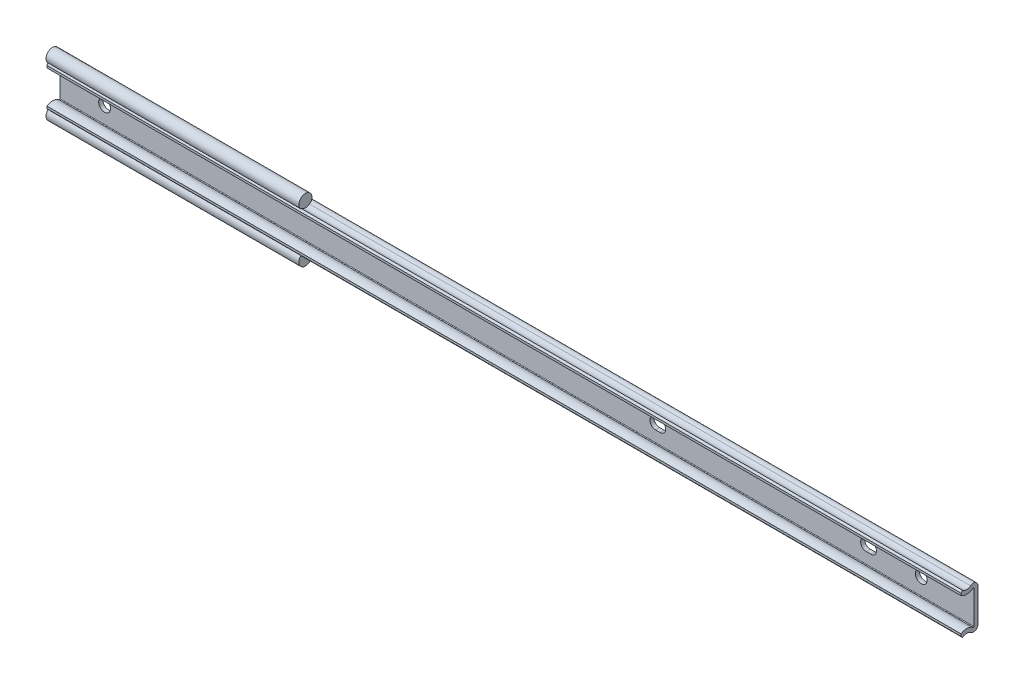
ISO-10303-21;
HEADER;
FILE_DESCRIPTION(('STEP AP214'),'2;1');
FILE_NAME('part.step','',(''),(''),'','','');
FILE_SCHEMA(('AUTOMOTIVE_DESIGN { 1 0 10303 214 1 1 1 1 }'));
ENDSEC;
DATA;
#1=APPLICATION_CONTEXT('core data for automotive mechanical design processes');
#2=APPLICATION_PROTOCOL_DEFINITION('international standard','automotive_design',2000,#1);
#3=PRODUCT_CONTEXT('',#1,'mechanical');
#4=PRODUCT('Part','Part','',(#3));
#5=PRODUCT_RELATED_PRODUCT_CATEGORY('part','',(#4));
#6=PRODUCT_DEFINITION_FORMATION('','',#4);
#7=PRODUCT_DEFINITION_CONTEXT('part definition',#1,'design');
#8=PRODUCT_DEFINITION('design','',#6,#7);
#9=PRODUCT_DEFINITION_SHAPE('','',#8);
#10=(LENGTH_UNIT() NAMED_UNIT(*) SI_UNIT(.MILLI.,.METRE.));
#11=(NAMED_UNIT(*) PLANE_ANGLE_UNIT() SI_UNIT($,.RADIAN.));
#12=(NAMED_UNIT(*) SI_UNIT($,.STERADIAN.) SOLID_ANGLE_UNIT());
#13=UNCERTAINTY_MEASURE_WITH_UNIT(LENGTH_MEASURE(1.E-05),#10,'distance_accuracy_value','');
#14=(GEOMETRIC_REPRESENTATION_CONTEXT(3) GLOBAL_UNCERTAINTY_ASSIGNED_CONTEXT((#13)) GLOBAL_UNIT_ASSIGNED_CONTEXT((#10,
#11,#12)) REPRESENTATION_CONTEXT('',''));
#15=CARTESIAN_POINT('',(0.,0.,0.));
#16=DIRECTION('',(0.,0.,1.));
#17=DIRECTION('',(1.,0.,0.));
#18=AXIS2_PLACEMENT_3D('',#15,#16,#17);
#19=CARTESIAN_POINT('',(330.,9.66999972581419,4.30999993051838));
#20=DIRECTION('',(-1.,0.,0.));
#21=DIRECTION('',(0.,0.,1.));
#22=AXIS2_PLACEMENT_3D('',#19,#20,#21);
#23=CYLINDRICAL_SURFACE('',#22,2.48000011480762);
#24=CARTESIAN_POINT('',(79.,9.66999972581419,4.3099999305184));
#25=DIRECTION('',(-1.,0.,0.));
#26=DIRECTION('',(0.,0.,1.));
#27=AXIS2_PLACEMENT_3D('',#24,#25,#26);
#28=CIRCLE('',#27,2.48000011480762);
#29=CARTESIAN_POINT('',(79.,7.77020940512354,5.90411325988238));
#30=VERTEX_POINT('',#29);
#31=CARTESIAN_POINT('',(79.,7.69573912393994,2.80910165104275));
#32=VERTEX_POINT('',#31);
#33=EDGE_CURVE('E228',#30,#32,#28,.F.);
#34=ORIENTED_EDGE('',*,*,#33,.F.);
#35=DIRECTION('',(-1.,0.,0.));
#36=VECTOR('',#35,1.);
#37=CARTESIAN_POINT('',(330.,7.77020940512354,5.90411325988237));
#38=LINE('',#37,#36);
#39=CARTESIAN_POINT('',(330.,7.77020940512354,5.90411325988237));
#40=VERTEX_POINT('',#39);
#41=EDGE_CURVE('E350',#40,#30,#38,.T.);
#42=ORIENTED_EDGE('',*,*,#41,.F.);
#43=CARTESIAN_POINT('',(330.,9.66999972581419,4.30999993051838));
#44=DIRECTION('',(-1.,0.,0.));
#45=DIRECTION('',(0.,0.,-1.));
#46=AXIS2_PLACEMENT_3D('',#43,#44,#45);
#47=CIRCLE('',#46,2.48000011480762);
#48=CARTESIAN_POINT('',(330.,7.69573912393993,2.80910165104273));
#49=VERTEX_POINT('',#48);
#50=EDGE_CURVE('E324',#49,#40,#47,.T.);
#51=ORIENTED_EDGE('',*,*,#50,.F.);
#52=DIRECTION('',(-1.,0.,0.));
#53=VECTOR('',#52,1.);
#54=CARTESIAN_POINT('',(330.,7.69573912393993,2.80910165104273));
#55=LINE('',#54,#53);
#56=EDGE_CURVE('E353',#49,#32,#55,.T.);
#57=ORIENTED_EDGE('',*,*,#56,.T.);
#58=EDGE_LOOP('',(#34,#42,#51,#57));
#59=FACE_BOUND('',#58,.T.);
#60=ADVANCED_FACE('F14',(#59),#23,.F.);
#61=CARTESIAN_POINT('',(330.,-9.66999990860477,4.30999993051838));
#62=DIRECTION('',(-1.,0.,0.));
#63=DIRECTION('',(0.,0.,1.));
#64=AXIS2_PLACEMENT_3D('',#61,#62,#63);
#65=CYLINDRICAL_SURFACE('',#64,4.03000011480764);
#66=DIRECTION('',(-1.,0.,0.));
#67=VECTOR('',#66,1.);
#68=CARTESIAN_POINT('',(330.,-6.46182654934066,1.87104018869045));
#69=LINE('',#68,#67);
#70=CARTESIAN_POINT('',(330.,-6.46182654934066,1.87104018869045));
#71=VERTEX_POINT('',#70);
#72=CARTESIAN_POINT('',(-17.,-6.46182654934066,1.87104018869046));
#73=VERTEX_POINT('',#72);
#74=EDGE_CURVE('E338',#71,#73,#69,.T.);
#75=ORIENTED_EDGE('',*,*,#74,.T.);
#76=CARTESIAN_POINT('',(-17.,-9.66999990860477,4.3099999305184));
#77=DIRECTION('',(-1.,0.,0.));
#78=DIRECTION('',(0.,0.,1.));
#79=AXIS2_PLACEMENT_3D('',#76,#77,#78);
#80=CIRCLE('',#79,4.03000011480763);
#81=CARTESIAN_POINT('',(-17.,-6.26775055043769,6.4699999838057));
#82=VERTEX_POINT('',#81);
#83=EDGE_CURVE('E232',#82,#73,#80,.T.);
#84=ORIENTED_EDGE('',*,*,#83,.F.);
#85=DIRECTION('',(-1.,0.,0.));
#86=VECTOR('',#85,1.);
#87=CARTESIAN_POINT('',(330.,-6.26775055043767,6.4699999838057));
#88=LINE('',#87,#86);
#89=CARTESIAN_POINT('',(330.,-6.26775055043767,6.4699999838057));
#90=VERTEX_POINT('',#89);
#91=EDGE_CURVE('E368',#90,#82,#88,.T.);
#92=ORIENTED_EDGE('',*,*,#91,.F.);
#93=CARTESIAN_POINT('',(330.,-9.66999990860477,4.30999993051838));
#94=DIRECTION('',(1.,0.,0.));
#95=DIRECTION('',(0.,0.,1.));
#96=AXIS2_PLACEMENT_3D('',#93,#94,#95);
#97=CIRCLE('',#96,4.03000011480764);
#98=EDGE_CURVE('E309',#71,#90,#97,.T.);
#99=ORIENTED_EDGE('',*,*,#98,.F.);
#100=EDGE_LOOP('',(#75,#84,#92,#99));
#101=FACE_BOUND('',#100,.T.);
#102=ADVANCED_FACE('F16',(#101),#65,.T.);
#103=CARTESIAN_POINT('',(330.,-6.26775055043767,6.4699999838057));
#104=DIRECTION('',(0.,0.,-1.));
#105=DIRECTION('',(-1.,0.,0.));
#106=AXIS2_PLACEMENT_3D('',#103,#104,#105);
#107=PLANE('',#106);
#108=ORIENTED_EDGE('',*,*,#91,.T.);
#109=DIRECTION('',(0.,1.,0.));
#110=VECTOR('',#109,1.);
#111=CARTESIAN_POINT('',(-17.,-7.09581181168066,6.46999998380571));
#112=LINE('',#111,#110);
#113=CARTESIAN_POINT('',(-17.,-7.09581181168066,6.46999998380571));
#114=VERTEX_POINT('',#113);
#115=EDGE_CURVE('E262',#114,#82,#112,.T.);
#116=ORIENTED_EDGE('',*,*,#115,.F.);
#117=DIRECTION('',(-1.,0.,0.));
#118=VECTOR('',#117,1.);
#119=CARTESIAN_POINT('',(330.,-7.09581181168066,6.4699999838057));
#120=LINE('',#119,#118);
#121=CARTESIAN_POINT('',(330.,-7.09581181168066,6.4699999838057));
#122=VERTEX_POINT('',#121);
#123=EDGE_CURVE('E366',#122,#114,#120,.T.);
#124=ORIENTED_EDGE('',*,*,#123,.F.);
#125=DIRECTION('',(0.,-1.,0.));
#126=VECTOR('',#125,1.);
#127=CARTESIAN_POINT('',(330.,-6.26775055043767,6.4699999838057));
#128=LINE('',#127,#126);
#129=EDGE_CURVE('E312',#90,#122,#128,.T.);
#130=ORIENTED_EDGE('',*,*,#129,.F.);
#131=EDGE_LOOP('',(#108,#116,#124,#130));
#132=FACE_BOUND('',#131,.T.);
#133=ADVANCED_FACE('F456',(#132),#107,.F.);
#134=CARTESIAN_POINT('',(330.,-7.77020958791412,5.90411325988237));
#135=DIRECTION('',(0.,0.642787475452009,-0.766044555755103));
#136=DIRECTION('',(0.,0.766044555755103,0.642787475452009));
#137=AXIS2_PLACEMENT_3D('',#134,#135,#136);
#138=PLANE('',#137);
#139=DIRECTION('',(0.,0.7660445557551,0.642787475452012));
#140=VECTOR('',#139,1.);
#141=CARTESIAN_POINT('',(-17.,-7.77020958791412,5.90411325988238));
#142=LINE('',#141,#140);
#143=CARTESIAN_POINT('',(-17.,-7.65539913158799,6.00045063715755));
#144=VERTEX_POINT('',#143);
#145=EDGE_CURVE('E211',#144,#114,#142,.T.);
#146=ORIENTED_EDGE('',*,*,#145,.F.);
#147=DIRECTION('',(-1.,0.,0.));
#148=VECTOR('',#147,1.);
#149=CARTESIAN_POINT('',(79.,-7.65539913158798,6.00045063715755));
#150=LINE('',#149,#148);
#151=CARTESIAN_POINT('',(79.,-7.65539913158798,6.00045063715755));
#152=VERTEX_POINT('',#151);
#153=EDGE_CURVE('E202',#144,#152,#150,.F.);
#154=ORIENTED_EDGE('',*,*,#153,.T.);
#155=DIRECTION('',(0.,-0.766044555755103,-0.642787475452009));
#156=VECTOR('',#155,1.);
#157=CARTESIAN_POINT('',(79.,-7.77020958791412,5.90411325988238));
#158=LINE('',#157,#156);
#159=CARTESIAN_POINT('',(79.,-7.77020958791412,5.90411325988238));
#160=VERTEX_POINT('',#159);
#161=EDGE_CURVE('E188',#152,#160,#158,.T.);
#162=ORIENTED_EDGE('',*,*,#161,.T.);
#163=DIRECTION('',(-1.,0.,0.));
#164=VECTOR('',#163,1.);
#165=CARTESIAN_POINT('',(330.,-7.77020958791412,5.90411325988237));
#166=LINE('',#165,#164);
#167=CARTESIAN_POINT('',(330.,-7.77020958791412,5.90411325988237));
#168=VERTEX_POINT('',#167);
#169=EDGE_CURVE('E364',#168,#160,#166,.T.);
#170=ORIENTED_EDGE('',*,*,#169,.F.);
#171=DIRECTION('',(0.,-0.766044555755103,-0.642787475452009));
#172=VECTOR('',#171,1.);
#173=CARTESIAN_POINT('',(330.,-7.77020958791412,5.90411325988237));
#174=LINE('',#173,#172);
#175=EDGE_CURVE('E314',#122,#168,#174,.T.);
#176=ORIENTED_EDGE('',*,*,#175,.F.);
#177=ORIENTED_EDGE('',*,*,#123,.T.);
#178=EDGE_LOOP('',(#146,#154,#162,#170,#176,#177));
#179=FACE_BOUND('',#178,.T.);
#180=ADVANCED_FACE('F209',(#179),#138,.F.);
#181=CARTESIAN_POINT('',(330.,-9.66999990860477,4.30999993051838));
#182=DIRECTION('',(-1.,0.,0.));
#183=DIRECTION('',(0.,0.,1.));
#184=AXIS2_PLACEMENT_3D('',#181,#182,#183);
#185=CYLINDRICAL_SURFACE('',#184,2.48000011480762);
#186=ORIENTED_EDGE('',*,*,#169,.T.);
#187=CARTESIAN_POINT('',(79.,-9.66999990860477,4.3099999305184));
#188=DIRECTION('',(1.,0.,0.));
#189=DIRECTION('',(0.,0.,-1.));
#190=AXIS2_PLACEMENT_3D('',#187,#188,#189);
#191=CIRCLE('',#190,2.48000011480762);
#192=CARTESIAN_POINT('',(79.,-7.69573930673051,2.80910165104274));
#193=VERTEX_POINT('',#192);
#194=EDGE_CURVE('E193',#160,#193,#191,.F.);
#195=ORIENTED_EDGE('',*,*,#194,.T.);
#196=DIRECTION('',(-1.,0.,0.));
#197=VECTOR('',#196,1.);
#198=CARTESIAN_POINT('',(330.,-7.69573930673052,2.80910165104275));
#199=LINE('',#198,#197);
#200=CARTESIAN_POINT('',(330.,-7.69573930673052,2.80910165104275));
#201=VERTEX_POINT('',#200);
#202=EDGE_CURVE('E361',#201,#193,#199,.T.);
#203=ORIENTED_EDGE('',*,*,#202,.F.);
#204=CARTESIAN_POINT('',(330.,-9.66999990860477,4.30999993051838));
#205=DIRECTION('',(-1.,0.,0.));
#206=DIRECTION('',(0.,0.,1.));
#207=AXIS2_PLACEMENT_3D('',#204,#205,#206);
#208=CIRCLE('',#207,2.48000011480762);
#209=EDGE_CURVE('E316',#168,#201,#208,.T.);
#210=ORIENTED_EDGE('',*,*,#209,.F.);
#211=EDGE_LOOP('',(#186,#195,#203,#210));
#212=FACE_BOUND('',#211,.T.);
#213=ADVANCED_FACE('F463',(#212),#185,.F.);
#214=CARTESIAN_POINT('',(330.,-6.302612,1.74999999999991));
#215=DIRECTION('',(-1.,0.,0.));
#216=DIRECTION('',(0.,0.,1.));
#217=AXIS2_PLACEMENT_3D('',#214,#215,#216);
#218=CYLINDRICAL_SURFACE('',#217,1.74999999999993);
#219=CARTESIAN_POINT('',(79.,-6.302612,1.74999999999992));
#220=DIRECTION('',(1.,0.,0.));
#221=DIRECTION('',(0.,0.,-1.));
#222=AXIS2_PLACEMENT_3D('',#219,#220,#221);
#223=CIRCLE('',#222,1.74999999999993);
#224=CARTESIAN_POINT('',(79.,-7.94495173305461,2.3543345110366));
#225=VERTEX_POINT('',#224);
#226=EDGE_CURVE('E9',#193,#225,#223,.T.);
#227=ORIENTED_EDGE('',*,*,#226,.T.);
#228=DIRECTION('',(-1.,0.,0.));
#229=VECTOR('',#228,1.);
#230=CARTESIAN_POINT('',(31.,-7.94495173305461,2.35433451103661));
#231=LINE('',#230,#229);
#232=CARTESIAN_POINT('',(-17.,-7.94495173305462,2.3543345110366));
#233=VERTEX_POINT('',#232);
#234=EDGE_CURVE('E205',#225,#233,#231,.T.);
#235=ORIENTED_EDGE('',*,*,#234,.T.);
#236=CARTESIAN_POINT('',(-17.,-6.302612,1.74999999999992));
#237=DIRECTION('',(-1.,0.,0.));
#238=DIRECTION('',(0.,0.,1.));
#239=AXIS2_PLACEMENT_3D('',#236,#237,#238);
#240=CIRCLE('',#239,1.74999999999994);
#241=CARTESIAN_POINT('',(-17.,-6.302612,0.));
#242=VERTEX_POINT('',#241);
#243=EDGE_CURVE('E258',#242,#233,#240,.T.);
#244=ORIENTED_EDGE('',*,*,#243,.F.);
#245=DIRECTION('',(-1.,0.,0.));
#246=VECTOR('',#245,1.);
#247=CARTESIAN_POINT('',(330.,-6.302612,0.));
#248=LINE('',#247,#246);
#249=CARTESIAN_POINT('',(330.,-6.302612,0.));
#250=VERTEX_POINT('',#249);
#251=EDGE_CURVE('E359',#250,#242,#248,.T.);
#252=ORIENTED_EDGE('',*,*,#251,.F.);
#253=CARTESIAN_POINT('',(330.,-6.302612,1.74999999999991));
#254=DIRECTION('',(1.,0.,0.));
#255=DIRECTION('',(0.,0.,1.));
#256=AXIS2_PLACEMENT_3D('',#253,#254,#255);
#257=CIRCLE('',#256,1.74999999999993);
#258=EDGE_CURVE('E318',#201,#250,#257,.T.);
#259=ORIENTED_EDGE('',*,*,#258,.F.);
#260=ORIENTED_EDGE('',*,*,#202,.T.);
#261=EDGE_LOOP('',(#227,#235,#244,#252,#259,#260));
#262=FACE_BOUND('',#261,.T.);
#263=ADVANCED_FACE('F465',(#262),#218,.T.);
#264=CARTESIAN_POINT('',(330.,-6.302612,0.));
#265=DIRECTION('',(0.,0.,1.));
#266=DIRECTION('',(1.,0.,0.));
#267=AXIS2_PLACEMENT_3D('',#264,#265,#266);
#268=PLANE('',#267);
#269=DIRECTION('',(-1.,0.,0.));
#270=VECTOR('',#269,1.);
#271=CARTESIAN_POINT('',(210.9,-2.1,0.));
#272=LINE('',#271,#270);
#273=CARTESIAN_POINT('',(210.9,-2.1,0.));
#274=VERTEX_POINT('',#273);
#275=CARTESIAN_POINT('',(209.1,-2.1,0.));
#276=VERTEX_POINT('',#275);
#277=EDGE_CURVE('E266',#274,#276,#272,.T.);
#278=ORIENTED_EDGE('',*,*,#277,.F.);
#279=CARTESIAN_POINT('',(210.9,0.,0.));
#280=DIRECTION('',(0.,0.,-1.));
#281=DIRECTION('',(-1.,0.,0.));
#282=AXIS2_PLACEMENT_3D('',#279,#280,#281);
#283=CIRCLE('',#282,2.1);
#284=CARTESIAN_POINT('',(210.9,2.1,0.));
#285=VERTEX_POINT('',#284);
#286=EDGE_CURVE('E29',#285,#274,#283,.T.);
#287=ORIENTED_EDGE('',*,*,#286,.F.);
#288=DIRECTION('',(1.,0.,0.));
#289=VECTOR('',#288,1.);
#290=CARTESIAN_POINT('',(210.9,2.1,0.));
#291=LINE('',#290,#289);
#292=CARTESIAN_POINT('',(209.1,2.1,0.));
#293=VERTEX_POINT('',#292);
#294=EDGE_CURVE('E271',#293,#285,#291,.T.);
#295=ORIENTED_EDGE('',*,*,#294,.F.);
#296=CARTESIAN_POINT('',(209.1,0.,0.));
#297=DIRECTION('',(0.,0.,-1.));
#298=DIRECTION('',(-1.,0.,0.));
#299=AXIS2_PLACEMENT_3D('',#296,#297,#298);
#300=CIRCLE('',#299,2.1);
#301=EDGE_CURVE('E268',#276,#293,#300,.T.);
#302=ORIENTED_EDGE('',*,*,#301,.F.);
#303=EDGE_LOOP('',(#278,#287,#295,#302));
#304=FACE_BOUND('',#303,.T.);
#305=DIRECTION('',(-1.,0.,0.));
#306=VECTOR('',#305,1.);
#307=CARTESIAN_POINT('',(290.9,-2.1,0.));
#308=LINE('',#307,#306);
#309=CARTESIAN_POINT('',(290.9,-2.1,0.));
#310=VERTEX_POINT('',#309);
#311=CARTESIAN_POINT('',(289.1,-2.1,0.));
#312=VERTEX_POINT('',#311);
#313=EDGE_CURVE('E283',#310,#312,#308,.T.);
#314=ORIENTED_EDGE('',*,*,#313,.F.);
#315=CARTESIAN_POINT('',(290.9,0.,0.));
#316=DIRECTION('',(0.,0.,-1.));
#317=DIRECTION('',(-1.,0.,0.));
#318=AXIS2_PLACEMENT_3D('',#315,#316,#317);
#319=CIRCLE('',#318,2.1);
#320=CARTESIAN_POINT('',(290.9,2.1,0.));
#321=VERTEX_POINT('',#320);
#322=EDGE_CURVE('E277',#321,#310,#319,.T.);
#323=ORIENTED_EDGE('',*,*,#322,.F.);
#324=DIRECTION('',(1.,0.,0.));
#325=VECTOR('',#324,1.);
#326=CARTESIAN_POINT('',(290.9,2.1,0.));
#327=LINE('',#326,#325);
#328=CARTESIAN_POINT('',(289.1,2.1,0.));
#329=VERTEX_POINT('',#328);
#330=EDGE_CURVE('E289',#329,#321,#327,.T.);
#331=ORIENTED_EDGE('',*,*,#330,.F.);
#332=CARTESIAN_POINT('',(289.1,0.,0.));
#333=DIRECTION('',(0.,0.,-1.));
#334=DIRECTION('',(-1.,0.,0.));
#335=AXIS2_PLACEMENT_3D('',#332,#333,#334);
#336=CIRCLE('',#335,2.1);
#337=EDGE_CURVE('E286',#312,#329,#336,.T.);
#338=ORIENTED_EDGE('',*,*,#337,.F.);
#339=EDGE_LOOP('',(#314,#323,#331,#338));
#340=FACE_BOUND('',#339,.T.);
#341=CARTESIAN_POINT('',(310.,0.,0.));
#342=DIRECTION('',(0.,0.,-1.));
#343=DIRECTION('',(-1.,0.,0.));
#344=AXIS2_PLACEMENT_3D('',#341,#342,#343);
#345=CIRCLE('',#344,2.24999999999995);
#346=CARTESIAN_POINT('',(307.75,0.,0.));
#347=VERTEX_POINT('',#346);
#348=EDGE_CURVE('E295',#347,#347,#345,.T.);
#349=ORIENTED_EDGE('',*,*,#348,.F.);
#350=EDGE_LOOP('',(#349));
#351=FACE_BOUND('',#350,.T.);
#352=CARTESIAN_POINT('',(0.,0.,0.));
#353=DIRECTION('',(0.,0.,-1.));
#354=DIRECTION('',(-1.,0.,0.));
#355=AXIS2_PLACEMENT_3D('',#352,#353,#354);
#356=CIRCLE('',#355,2.25);
#357=CARTESIAN_POINT('',(-2.25,0.,0.));
#358=VERTEX_POINT('',#357);
#359=EDGE_CURVE('E305',#358,#358,#356,.T.);
#360=ORIENTED_EDGE('',*,*,#359,.F.);
#361=EDGE_LOOP('',(#360));
#362=FACE_BOUND('',#361,.T.);
#363=ORIENTED_EDGE('',*,*,#251,.T.);
#364=DIRECTION('',(0.,-1.,0.));
#365=VECTOR('',#364,1.);
#366=CARTESIAN_POINT('',(-17.,6.30261181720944,0.));
#367=LINE('',#366,#365);
#368=CARTESIAN_POINT('',(-17.,6.30261181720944,0.));
#369=VERTEX_POINT('',#368);
#370=EDGE_CURVE('E255',#369,#242,#367,.T.);
#371=ORIENTED_EDGE('',*,*,#370,.F.);
#372=DIRECTION('',(-1.,0.,0.));
#373=VECTOR('',#372,1.);
#374=CARTESIAN_POINT('',(330.,6.30261181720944,0.));
#375=LINE('',#374,#373);
#376=CARTESIAN_POINT('',(330.,6.30261181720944,0.));
#377=VERTEX_POINT('',#376);
#378=EDGE_CURVE('E356',#377,#369,#375,.T.);
#379=ORIENTED_EDGE('',*,*,#378,.F.);
#380=DIRECTION('',(0.,1.,0.));
#381=VECTOR('',#380,1.);
#382=CARTESIAN_POINT('',(330.,-6.302612,0.));
#383=LINE('',#382,#381);
#384=EDGE_CURVE('E320',#250,#377,#383,.T.);
#385=ORIENTED_EDGE('',*,*,#384,.F.);
#386=EDGE_LOOP('',(#363,#371,#379,#385));
#387=FACE_BOUND('',#386,.T.);
#388=ADVANCED_FACE('F469',(#304,#340,#351,#362,#387),#268,.F.);
#389=CARTESIAN_POINT('',(330.,6.30261181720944,1.74999999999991));
#390=DIRECTION('',(-1.,0.,0.));
#391=DIRECTION('',(0.,0.,1.));
#392=AXIS2_PLACEMENT_3D('',#389,#390,#391);
#393=CYLINDRICAL_SURFACE('',#392,1.74999999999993);
#394=CARTESIAN_POINT('',(-17.,6.30261181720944,1.74999999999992));
#395=DIRECTION('',(-1.,0.,0.));
#396=DIRECTION('',(0.,0.,1.));
#397=AXIS2_PLACEMENT_3D('',#394,#395,#396);
#398=CIRCLE('',#397,1.74999999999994);
#399=CARTESIAN_POINT('',(-17.,7.94495155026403,2.3543345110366));
#400=VERTEX_POINT('',#399);
#401=EDGE_CURVE('E253',#400,#369,#398,.T.);
#402=ORIENTED_EDGE('',*,*,#401,.F.);
#403=DIRECTION('',(-1.,0.,0.));
#404=VECTOR('',#403,1.);
#405=CARTESIAN_POINT('',(31.,7.94495155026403,2.35433451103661));
#406=LINE('',#405,#404);
#407=CARTESIAN_POINT('',(79.,7.94495155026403,2.3543345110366));
#408=VERTEX_POINT('',#407);
#409=EDGE_CURVE('E225',#400,#408,#406,.F.);
#410=ORIENTED_EDGE('',*,*,#409,.T.);
#411=CARTESIAN_POINT('',(79.,6.30261181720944,1.74999999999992));
#412=DIRECTION('',(-1.,0.,0.));
#413=DIRECTION('',(0.,0.,1.));
#414=AXIS2_PLACEMENT_3D('',#411,#412,#413);
#415=CIRCLE('',#414,1.74999999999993);
#416=EDGE_CURVE('E230',#32,#408,#415,.T.);
#417=ORIENTED_EDGE('',*,*,#416,.F.);
#418=ORIENTED_EDGE('',*,*,#56,.F.);
#419=CARTESIAN_POINT('',(330.,6.30261181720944,1.74999999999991));
#420=DIRECTION('',(1.,0.,0.));
#421=DIRECTION('',(0.,0.,-1.));
#422=AXIS2_PLACEMENT_3D('',#419,#420,#421);
#423=CIRCLE('',#422,1.74999999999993);
#424=EDGE_CURVE('E322',#377,#49,#423,.T.);
#425=ORIENTED_EDGE('',*,*,#424,.F.);
#426=ORIENTED_EDGE('',*,*,#378,.T.);
#427=EDGE_LOOP('',(#402,#410,#417,#418,#425,#426));
#428=FACE_BOUND('',#427,.T.);
#429=ADVANCED_FACE('F421',(#428),#393,.T.);
#430=CARTESIAN_POINT('',(330.,7.77020940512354,5.90411325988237));
#431=DIRECTION('',(0.,-0.642787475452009,-0.766044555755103));
#432=DIRECTION('',(0.,0.766044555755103,-0.642787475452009));
#433=AXIS2_PLACEMENT_3D('',#430,#431,#432);
#434=PLANE('',#433);
#435=DIRECTION('',(0.,0.766044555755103,-0.642787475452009));
#436=VECTOR('',#435,1.);
#437=CARTESIAN_POINT('',(79.,7.77020940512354,5.90411325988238));
#438=LINE('',#437,#436);
#439=CARTESIAN_POINT('',(79.,7.6553989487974,6.00045063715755));
#440=VERTEX_POINT('',#439);
#441=EDGE_CURVE('E22',#440,#30,#438,.T.);
#442=ORIENTED_EDGE('',*,*,#441,.F.);
#443=DIRECTION('',(-1.,0.,0.));
#444=VECTOR('',#443,1.);
#445=CARTESIAN_POINT('',(79.,7.6553989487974,6.00045063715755));
#446=LINE('',#445,#444);
#447=CARTESIAN_POINT('',(-17.,7.6553989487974,6.00045063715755));
#448=VERTEX_POINT('',#447);
#449=EDGE_CURVE('E220',#440,#448,#446,.T.);
#450=ORIENTED_EDGE('',*,*,#449,.T.);
#451=DIRECTION('',(0.,0.7660445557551,-0.642787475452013));
#452=VECTOR('',#451,1.);
#453=CARTESIAN_POINT('',(-17.,7.09581162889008,6.46999998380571));
#454=LINE('',#453,#452);
#455=CARTESIAN_POINT('',(-17.,7.09581162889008,6.46999998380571));
#456=VERTEX_POINT('',#455);
#457=EDGE_CURVE('E250',#456,#448,#454,.T.);
#458=ORIENTED_EDGE('',*,*,#457,.F.);
#459=DIRECTION('',(-1.,0.,0.));
#460=VECTOR('',#459,1.);
#461=CARTESIAN_POINT('',(330.,7.09581162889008,6.4699999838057));
#462=LINE('',#461,#460);
#463=CARTESIAN_POINT('',(330.,7.09581162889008,6.4699999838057));
#464=VERTEX_POINT('',#463);
#465=EDGE_CURVE('E348',#464,#456,#462,.T.);
#466=ORIENTED_EDGE('',*,*,#465,.F.);
#467=DIRECTION('',(0.,-0.766044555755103,0.642787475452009));
#468=VECTOR('',#467,1.);
#469=CARTESIAN_POINT('',(330.,7.77020940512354,5.90411325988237));
#470=LINE('',#469,#468);
#471=EDGE_CURVE('E326',#40,#464,#470,.T.);
#472=ORIENTED_EDGE('',*,*,#471,.F.);
#473=ORIENTED_EDGE('',*,*,#41,.T.);
#474=EDGE_LOOP('',(#442,#450,#458,#466,#472,#473));
#475=FACE_BOUND('',#474,.T.);
#476=ADVANCED_FACE('F409',(#475),#434,.F.);
#477=CARTESIAN_POINT('',(330.,6.26775036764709,6.4699999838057));
#478=DIRECTION('',(0.,0.,-1.));
#479=DIRECTION('',(-1.,0.,0.));
#480=AXIS2_PLACEMENT_3D('',#477,#478,#479);
#481=PLANE('',#480);
#482=ORIENTED_EDGE('',*,*,#465,.T.);
#483=DIRECTION('',(0.,1.,0.));
#484=VECTOR('',#483,1.);
#485=CARTESIAN_POINT('',(-17.,6.26775036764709,6.46999998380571));
#486=LINE('',#485,#484);
#487=CARTESIAN_POINT('',(-17.,6.26775036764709,6.46999998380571));
#488=VERTEX_POINT('',#487);
#489=EDGE_CURVE('E247',#488,#456,#486,.T.);
#490=ORIENTED_EDGE('',*,*,#489,.F.);
#491=DIRECTION('',(-1.,0.,0.));
#492=VECTOR('',#491,1.);
#493=CARTESIAN_POINT('',(330.,6.26775036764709,6.4699999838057));
#494=LINE('',#493,#492);
#495=CARTESIAN_POINT('',(330.,6.26775036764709,6.4699999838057));
#496=VERTEX_POINT('',#495);
#497=EDGE_CURVE('E346',#496,#488,#494,.T.);
#498=ORIENTED_EDGE('',*,*,#497,.F.);
#499=DIRECTION('',(0.,-1.,0.));
#500=VECTOR('',#499,1.);
#501=CARTESIAN_POINT('',(330.,6.26775036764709,6.4699999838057));
#502=LINE('',#501,#500);
#503=EDGE_CURVE('E328',#464,#496,#502,.T.);
#504=ORIENTED_EDGE('',*,*,#503,.F.);
#505=EDGE_LOOP('',(#482,#490,#498,#504));
#506=FACE_BOUND('',#505,.T.);
#507=ADVANCED_FACE('F429',(#506),#481,.F.);
#508=CARTESIAN_POINT('',(330.,9.66999972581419,4.30999993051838));
#509=DIRECTION('',(-1.,0.,0.));
#510=DIRECTION('',(0.,0.,1.));
#511=AXIS2_PLACEMENT_3D('',#508,#509,#510);
#512=CYLINDRICAL_SURFACE('',#511,4.03000011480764);
#513=ORIENTED_EDGE('',*,*,#497,.T.);
#514=CARTESIAN_POINT('',(-17.,9.66999972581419,4.3099999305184));
#515=DIRECTION('',(-1.,0.,0.));
#516=DIRECTION('',(0.,0.,1.));
#517=AXIS2_PLACEMENT_3D('',#514,#515,#516);
#518=CIRCLE('',#517,4.03000011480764);
#519=CARTESIAN_POINT('',(-17.,6.46182636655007,1.87104018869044));
#520=VERTEX_POINT('',#519);
#521=EDGE_CURVE('E244',#520,#488,#518,.T.);
#522=ORIENTED_EDGE('',*,*,#521,.F.);
#523=DIRECTION('',(-1.,0.,0.));
#524=VECTOR('',#523,1.);
#525=CARTESIAN_POINT('',(330.,6.46182636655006,1.87104018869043));
#526=LINE('',#525,#524);
#527=CARTESIAN_POINT('',(330.,6.46182636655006,1.87104018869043));
#528=VERTEX_POINT('',#527);
#529=EDGE_CURVE('E344',#528,#520,#526,.T.);
#530=ORIENTED_EDGE('',*,*,#529,.F.);
#531=CARTESIAN_POINT('',(330.,9.66999972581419,4.30999993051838));
#532=DIRECTION('',(1.,0.,0.));
#533=DIRECTION('',(0.,0.,-1.));
#534=AXIS2_PLACEMENT_3D('',#531,#532,#533);
#535=CIRCLE('',#534,4.03000011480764);
#536=EDGE_CURVE('E330',#496,#528,#535,.T.);
#537=ORIENTED_EDGE('',*,*,#536,.F.);
#538=EDGE_LOOP('',(#513,#522,#530,#537));
#539=FACE_BOUND('',#538,.T.);
#540=ADVANCED_FACE('F433',(#539),#512,.T.);
#541=CARTESIAN_POINT('',(330.,6.30261181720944,1.74999999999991));
#542=DIRECTION('',(-1.,0.,0.));
#543=DIRECTION('',(0.,0.,1.));
#544=AXIS2_PLACEMENT_3D('',#541,#542,#543);
#545=CYLINDRICAL_SURFACE('',#544,0.199999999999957);
#546=ORIENTED_EDGE('',*,*,#529,.T.);
#547=CARTESIAN_POINT('',(-17.,6.30261181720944,1.74999999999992));
#548=DIRECTION('',(1.,0.,0.));
#549=DIRECTION('',(0.,0.,1.));
#550=AXIS2_PLACEMENT_3D('',#547,#548,#549);
#551=CIRCLE('',#550,0.199999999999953);
#552=CARTESIAN_POINT('',(-17.,6.30261181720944,1.54999999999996));
#553=VERTEX_POINT('',#552);
#554=EDGE_CURVE('E241',#553,#520,#551,.T.);
#555=ORIENTED_EDGE('',*,*,#554,.F.);
#556=DIRECTION('',(-1.,0.,0.));
#557=VECTOR('',#556,1.);
#558=CARTESIAN_POINT('',(330.,6.30261181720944,1.54999999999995));
#559=LINE('',#558,#557);
#560=CARTESIAN_POINT('',(330.,6.30261181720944,1.54999999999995));
#561=VERTEX_POINT('',#560);
#562=EDGE_CURVE('E342',#561,#553,#559,.T.);
#563=ORIENTED_EDGE('',*,*,#562,.F.);
#564=CARTESIAN_POINT('',(330.,6.30261181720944,1.74999999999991));
#565=DIRECTION('',(-1.,0.,0.));
#566=DIRECTION('',(0.,0.,-1.));
#567=AXIS2_PLACEMENT_3D('',#564,#565,#566);
#568=CIRCLE('',#567,0.199999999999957);
#569=EDGE_CURVE('E332',#528,#561,#568,.T.);
#570=ORIENTED_EDGE('',*,*,#569,.F.);
#571=EDGE_LOOP('',(#546,#555,#563,#570));
#572=FACE_BOUND('',#571,.T.);
#573=ADVANCED_FACE('F440',(#572),#545,.F.);
#574=CARTESIAN_POINT('',(330.,-6.302612,1.54999999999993));
#575=DIRECTION('',(0.,0.,-1.));
#576=DIRECTION('',(-1.,0.,0.));
#577=AXIS2_PLACEMENT_3D('',#574,#575,#576);
#578=PLANE('',#577);
#579=DIRECTION('',(1.,0.,0.));
#580=VECTOR('',#579,1.);
#581=CARTESIAN_POINT('',(330.,2.1,1.54999999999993));
#582=LINE('',#581,#580);
#583=CARTESIAN_POINT('',(209.1,2.1,1.54999999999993));
#584=VERTEX_POINT('',#583);
#585=CARTESIAN_POINT('',(210.9,2.1,1.54999999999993));
#586=VERTEX_POINT('',#585);
#587=EDGE_CURVE('E392',#584,#586,#582,.T.);
#588=ORIENTED_EDGE('',*,*,#587,.T.);
#589=CARTESIAN_POINT('',(210.9,0.,1.54999999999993));
#590=DIRECTION('',(0.,0.,-1.));
#591=DIRECTION('',(-1.,0.,0.));
#592=AXIS2_PLACEMENT_3D('',#589,#590,#591);
#593=CIRCLE('',#592,2.1);
#594=CARTESIAN_POINT('',(210.9,-2.1,1.54999999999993));
#595=VERTEX_POINT('',#594);
#596=EDGE_CURVE('E395',#586,#595,#593,.T.);
#597=ORIENTED_EDGE('',*,*,#596,.T.);
#598=DIRECTION('',(-1.,0.,0.));
#599=VECTOR('',#598,1.);
#600=CARTESIAN_POINT('',(330.,-2.1,1.54999999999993));
#601=LINE('',#600,#599);
#602=CARTESIAN_POINT('',(209.1,-2.1,1.54999999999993));
#603=VERTEX_POINT('',#602);
#604=EDGE_CURVE('E386',#595,#603,#601,.T.);
#605=ORIENTED_EDGE('',*,*,#604,.T.);
#606=CARTESIAN_POINT('',(209.1,0.,1.54999999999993));
#607=DIRECTION('',(0.,0.,-1.));
#608=DIRECTION('',(-1.,0.,0.));
#609=AXIS2_PLACEMENT_3D('',#606,#607,#608);
#610=CIRCLE('',#609,2.1);
#611=EDGE_CURVE('E389',#603,#584,#610,.T.);
#612=ORIENTED_EDGE('',*,*,#611,.T.);
#613=EDGE_LOOP('',(#588,#597,#605,#612));
#614=FACE_BOUND('',#613,.T.);
#615=DIRECTION('',(1.,0.,0.));
#616=VECTOR('',#615,1.);
#617=CARTESIAN_POINT('',(330.,2.1,1.54999999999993));
#618=LINE('',#617,#616);
#619=CARTESIAN_POINT('',(289.1,2.1,1.54999999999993));
#620=VERTEX_POINT('',#619);
#621=CARTESIAN_POINT('',(290.9,2.1,1.54999999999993));
#622=VERTEX_POINT('',#621);
#623=EDGE_CURVE('E380',#620,#622,#618,.T.);
#624=ORIENTED_EDGE('',*,*,#623,.T.);
#625=CARTESIAN_POINT('',(290.9,0.,1.54999999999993));
#626=DIRECTION('',(0.,0.,-1.));
#627=DIRECTION('',(-1.,0.,0.));
#628=AXIS2_PLACEMENT_3D('',#625,#626,#627);
#629=CIRCLE('',#628,2.1);
#630=CARTESIAN_POINT('',(290.9,-2.1,1.54999999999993));
#631=VERTEX_POINT('',#630);
#632=EDGE_CURVE('E383',#622,#631,#629,.T.);
#633=ORIENTED_EDGE('',*,*,#632,.T.);
#634=DIRECTION('',(-1.,0.,0.));
#635=VECTOR('',#634,1.);
#636=CARTESIAN_POINT('',(330.,-2.1,1.54999999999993));
#637=LINE('',#636,#635);
#638=CARTESIAN_POINT('',(289.1,-2.1,1.54999999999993));
#639=VERTEX_POINT('',#638);
#640=EDGE_CURVE('E370',#631,#639,#637,.T.);
#641=ORIENTED_EDGE('',*,*,#640,.T.);
#642=CARTESIAN_POINT('',(289.1,0.,1.54999999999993));
#643=DIRECTION('',(0.,0.,-1.));
#644=DIRECTION('',(-1.,0.,0.));
#645=AXIS2_PLACEMENT_3D('',#642,#643,#644);
#646=CIRCLE('',#645,2.1);
#647=EDGE_CURVE('E377',#639,#620,#646,.T.);
#648=ORIENTED_EDGE('',*,*,#647,.T.);
#649=EDGE_LOOP('',(#624,#633,#641,#648));
#650=FACE_BOUND('',#649,.T.);
#651=CARTESIAN_POINT('',(310.,0.,1.54999999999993));
#652=DIRECTION('',(0.,0.,-1.));
#653=DIRECTION('',(-1.,0.,0.));
#654=AXIS2_PLACEMENT_3D('',#651,#652,#653);
#655=CIRCLE('',#654,2.24999999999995);
#656=CARTESIAN_POINT('',(307.75,0.,1.54999999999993));
#657=VERTEX_POINT('',#656);
#658=EDGE_CURVE('E304',#657,#657,#655,.T.);
#659=ORIENTED_EDGE('',*,*,#658,.T.);
#660=EDGE_LOOP('',(#659));
#661=FACE_BOUND('',#660,.T.);
#662=CARTESIAN_POINT('',(0.,0.,1.54999999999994));
#663=DIRECTION('',(0.,0.,-1.));
#664=DIRECTION('',(-1.,0.,0.));
#665=AXIS2_PLACEMENT_3D('',#662,#663,#664);
#666=CIRCLE('',#665,2.25);
#667=CARTESIAN_POINT('',(-2.25,0.,1.54999999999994));
#668=VERTEX_POINT('',#667);
#669=EDGE_CURVE('E308',#668,#668,#666,.T.);
#670=ORIENTED_EDGE('',*,*,#669,.T.);
#671=EDGE_LOOP('',(#670));
#672=FACE_BOUND('',#671,.T.);
#673=ORIENTED_EDGE('',*,*,#562,.T.);
#674=DIRECTION('',(0.,1.,0.));
#675=VECTOR('',#674,1.);
#676=CARTESIAN_POINT('',(-17.,-6.302612,1.54999999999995));
#677=LINE('',#676,#675);
#678=CARTESIAN_POINT('',(-17.,-6.302612,1.54999999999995));
#679=VERTEX_POINT('',#678);
#680=EDGE_CURVE('E238',#679,#553,#677,.T.);
#681=ORIENTED_EDGE('',*,*,#680,.F.);
#682=DIRECTION('',(-1.,0.,0.));
#683=VECTOR('',#682,1.);
#684=CARTESIAN_POINT('',(330.,-6.302612,1.54999999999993));
#685=LINE('',#684,#683);
#686=CARTESIAN_POINT('',(330.,-6.302612,1.54999999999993));
#687=VERTEX_POINT('',#686);
#688=EDGE_CURVE('E340',#687,#679,#685,.T.);
#689=ORIENTED_EDGE('',*,*,#688,.F.);
#690=DIRECTION('',(0.,-1.,0.));
#691=VECTOR('',#690,1.);
#692=CARTESIAN_POINT('',(330.,-6.302612,1.54999999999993));
#693=LINE('',#692,#691);
#694=EDGE_CURVE('E334',#561,#687,#693,.T.);
#695=ORIENTED_EDGE('',*,*,#694,.F.);
#696=EDGE_LOOP('',(#673,#681,#689,#695));
#697=FACE_BOUND('',#696,.T.);
#698=ADVANCED_FACE('F443',(#614,#650,#661,#672,#697),#578,.F.);
#699=CARTESIAN_POINT('',(330.,-6.302612,1.74999999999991));
#700=DIRECTION('',(-1.,0.,0.));
#701=DIRECTION('',(0.,0.,1.));
#702=AXIS2_PLACEMENT_3D('',#699,#700,#701);
#703=CYLINDRICAL_SURFACE('',#702,0.199999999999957);
#704=ORIENTED_EDGE('',*,*,#688,.T.);
#705=CARTESIAN_POINT('',(-17.,-6.302612,1.74999999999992));
#706=DIRECTION('',(1.,0.,0.));
#707=DIRECTION('',(0.,0.,1.));
#708=AXIS2_PLACEMENT_3D('',#705,#706,#707);
#709=CIRCLE('',#708,0.199999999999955);
#710=EDGE_CURVE('E235',#73,#679,#709,.T.);
#711=ORIENTED_EDGE('',*,*,#710,.F.);
#712=ORIENTED_EDGE('',*,*,#74,.F.);
#713=CARTESIAN_POINT('',(330.,-6.302612,1.74999999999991));
#714=DIRECTION('',(-1.,0.,0.));
#715=DIRECTION('',(0.,0.,1.));
#716=AXIS2_PLACEMENT_3D('',#713,#714,#715);
#717=CIRCLE('',#716,0.199999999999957);
#718=EDGE_CURVE('E336',#687,#71,#717,.T.);
#719=ORIENTED_EDGE('',*,*,#718,.F.);
#720=EDGE_LOOP('',(#704,#711,#712,#719));
#721=FACE_BOUND('',#720,.T.);
#722=ADVANCED_FACE('F448',(#721),#703,.F.);
#723=CARTESIAN_POINT('',(330.,-9.66999990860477,4.30999993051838));
#724=DIRECTION('',(-1.,0.,0.));
#725=DIRECTION('',(0.,0.,1.));
#726=AXIS2_PLACEMENT_3D('',#723,#724,#725);
#727=PLANE('',#726);
#728=ORIENTED_EDGE('',*,*,#98,.T.);
#729=ORIENTED_EDGE('',*,*,#129,.T.);
#730=ORIENTED_EDGE('',*,*,#175,.T.);
#731=ORIENTED_EDGE('',*,*,#209,.T.);
#732=ORIENTED_EDGE('',*,*,#258,.T.);
#733=ORIENTED_EDGE('',*,*,#384,.T.);
#734=ORIENTED_EDGE('',*,*,#424,.T.);
#735=ORIENTED_EDGE('',*,*,#50,.T.);
#736=ORIENTED_EDGE('',*,*,#471,.T.);
#737=ORIENTED_EDGE('',*,*,#503,.T.);
#738=ORIENTED_EDGE('',*,*,#536,.T.);
#739=ORIENTED_EDGE('',*,*,#569,.T.);
#740=ORIENTED_EDGE('',*,*,#694,.T.);
#741=ORIENTED_EDGE('',*,*,#718,.T.);
#742=EDGE_LOOP('',(#728,#729,#730,#731,#732,#733,#734,#735,#736,#737,#738,#739,#740,#741));
#743=FACE_BOUND('',#742,.T.);
#744=ADVANCED_FACE('F414',(#743),#727,.F.);
#745=CARTESIAN_POINT('',(0.,0.,6.46999998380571));
#746=DIRECTION('',(0.,0.,-1.));
#747=DIRECTION('',(-1.,0.,0.));
#748=AXIS2_PLACEMENT_3D('',#745,#746,#747);
#749=CYLINDRICAL_SURFACE('',#748,2.25);
#750=ORIENTED_EDGE('',*,*,#359,.T.);
#751=EDGE_LOOP('',(#750));
#752=FACE_BOUND('',#751,.T.);
#753=ORIENTED_EDGE('',*,*,#669,.F.);
#754=EDGE_LOOP('',(#753));
#755=FACE_BOUND('',#754,.T.);
#756=ADVANCED_FACE('F505',(#752,#755),#749,.F.);
#757=CARTESIAN_POINT('',(310.,0.,6.4699999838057));
#758=DIRECTION('',(0.,0.,-1.));
#759=DIRECTION('',(-1.,0.,0.));
#760=AXIS2_PLACEMENT_3D('',#757,#758,#759);
#761=CYLINDRICAL_SURFACE('',#760,2.24999999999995);
#762=ORIENTED_EDGE('',*,*,#348,.T.);
#763=EDGE_LOOP('',(#762));
#764=FACE_BOUND('',#763,.T.);
#765=ORIENTED_EDGE('',*,*,#658,.F.);
#766=EDGE_LOOP('',(#765));
#767=FACE_BOUND('',#766,.T.);
#768=ADVANCED_FACE('F508',(#764,#767),#761,.F.);
#769=CARTESIAN_POINT('',(290.9,0.,6.4699999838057));
#770=DIRECTION('',(0.,0.,-1.));
#771=DIRECTION('',(-1.,0.,0.));
#772=AXIS2_PLACEMENT_3D('',#769,#770,#771);
#773=CYLINDRICAL_SURFACE('',#772,2.1);
#774=DIRECTION('',(0.,0.,-1.));
#775=VECTOR('',#774,1.);
#776=CARTESIAN_POINT('',(290.9,2.1,6.4699999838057));
#777=LINE('',#776,#775);
#778=EDGE_CURVE('E293',#622,#321,#777,.T.);
#779=ORIENTED_EDGE('',*,*,#778,.T.);
#780=ORIENTED_EDGE('',*,*,#322,.T.);
#781=DIRECTION('',(0.,0.,-1.));
#782=VECTOR('',#781,1.);
#783=CARTESIAN_POINT('',(290.9,-2.1,6.4699999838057));
#784=LINE('',#783,#782);
#785=EDGE_CURVE('E292',#631,#310,#784,.T.);
#786=ORIENTED_EDGE('',*,*,#785,.F.);
#787=ORIENTED_EDGE('',*,*,#632,.F.);
#788=EDGE_LOOP('',(#779,#780,#786,#787));
#789=FACE_BOUND('',#788,.T.);
#790=ADVANCED_FACE('F512',(#789),#773,.F.);
#791=CARTESIAN_POINT('',(290.9,2.1,6.4699999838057));
#792=DIRECTION('',(0.,1.,0.));
#793=DIRECTION('',(1.,0.,0.));
#794=AXIS2_PLACEMENT_3D('',#791,#792,#793);
#795=PLANE('',#794);
#796=DIRECTION('',(0.,0.,-1.));
#797=VECTOR('',#796,1.);
#798=CARTESIAN_POINT('',(289.1,2.1,6.4699999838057));
#799=LINE('',#798,#797);
#800=EDGE_CURVE('E296',#620,#329,#799,.T.);
#801=ORIENTED_EDGE('',*,*,#800,.T.);
#802=ORIENTED_EDGE('',*,*,#330,.T.);
#803=ORIENTED_EDGE('',*,*,#778,.F.);
#804=ORIENTED_EDGE('',*,*,#623,.F.);
#805=EDGE_LOOP('',(#801,#802,#803,#804));
#806=FACE_BOUND('',#805,.T.);
#807=ADVANCED_FACE('F516',(#806),#795,.F.);
#808=CARTESIAN_POINT('',(289.1,0.,6.4699999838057));
#809=DIRECTION('',(0.,0.,-1.));
#810=DIRECTION('',(-1.,0.,0.));
#811=AXIS2_PLACEMENT_3D('',#808,#809,#810);
#812=CYLINDRICAL_SURFACE('',#811,2.1);
#813=DIRECTION('',(0.,0.,-1.));
#814=VECTOR('',#813,1.);
#815=CARTESIAN_POINT('',(289.1,-2.1,6.4699999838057));
#816=LINE('',#815,#814);
#817=EDGE_CURVE('E298',#639,#312,#816,.T.);
#818=ORIENTED_EDGE('',*,*,#817,.T.);
#819=ORIENTED_EDGE('',*,*,#337,.T.);
#820=ORIENTED_EDGE('',*,*,#800,.F.);
#821=ORIENTED_EDGE('',*,*,#647,.F.);
#822=EDGE_LOOP('',(#818,#819,#820,#821));
#823=FACE_BOUND('',#822,.T.);
#824=ADVANCED_FACE('F522',(#823),#812,.F.);
#825=CARTESIAN_POINT('',(290.9,-2.1,6.4699999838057));
#826=DIRECTION('',(0.,-1.,0.));
#827=DIRECTION('',(-1.,0.,0.));
#828=AXIS2_PLACEMENT_3D('',#825,#826,#827);
#829=PLANE('',#828);
#830=ORIENTED_EDGE('',*,*,#785,.T.);
#831=ORIENTED_EDGE('',*,*,#313,.T.);
#832=ORIENTED_EDGE('',*,*,#817,.F.);
#833=ORIENTED_EDGE('',*,*,#640,.F.);
#834=EDGE_LOOP('',(#830,#831,#832,#833));
#835=FACE_BOUND('',#834,.T.);
#836=ADVANCED_FACE('F518',(#835),#829,.F.);
#837=CARTESIAN_POINT('',(210.9,0.,6.46999998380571));
#838=DIRECTION('',(0.,0.,-1.));
#839=DIRECTION('',(-1.,0.,0.));
#840=AXIS2_PLACEMENT_3D('',#837,#838,#839);
#841=CYLINDRICAL_SURFACE('',#840,2.1);
#842=DIRECTION('',(0.,0.,-1.));
#843=VECTOR('',#842,1.);
#844=CARTESIAN_POINT('',(210.9,2.1,6.46999998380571));
#845=LINE('',#844,#843);
#846=EDGE_CURVE('E275',#586,#285,#845,.T.);
#847=ORIENTED_EDGE('',*,*,#846,.T.);
#848=ORIENTED_EDGE('',*,*,#286,.T.);
#849=DIRECTION('',(0.,0.,-1.));
#850=VECTOR('',#849,1.);
#851=CARTESIAN_POINT('',(210.9,-2.1,6.46999998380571));
#852=LINE('',#851,#850);
#853=EDGE_CURVE('E274',#595,#274,#852,.T.);
#854=ORIENTED_EDGE('',*,*,#853,.F.);
#855=ORIENTED_EDGE('',*,*,#596,.F.);
#856=EDGE_LOOP('',(#847,#848,#854,#855));
#857=FACE_BOUND('',#856,.T.);
#858=ADVANCED_FACE('F521',(#857),#841,.F.);
#859=CARTESIAN_POINT('',(210.9,2.1,6.46999998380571));
#860=DIRECTION('',(0.,1.,0.));
#861=DIRECTION('',(1.,0.,0.));
#862=AXIS2_PLACEMENT_3D('',#859,#860,#861);
#863=PLANE('',#862);
#864=DIRECTION('',(0.,0.,-1.));
#865=VECTOR('',#864,1.);
#866=CARTESIAN_POINT('',(209.1,2.1,6.46999998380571));
#867=LINE('',#866,#865);
#868=EDGE_CURVE('E278',#584,#293,#867,.T.);
#869=ORIENTED_EDGE('',*,*,#868,.T.);
#870=ORIENTED_EDGE('',*,*,#294,.T.);
#871=ORIENTED_EDGE('',*,*,#846,.F.);
#872=ORIENTED_EDGE('',*,*,#587,.F.);
#873=EDGE_LOOP('',(#869,#870,#871,#872));
#874=FACE_BOUND('',#873,.T.);
#875=ADVANCED_FACE('F532',(#874),#863,.F.);
#876=CARTESIAN_POINT('',(209.1,0.,6.46999998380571));
#877=DIRECTION('',(0.,0.,-1.));
#878=DIRECTION('',(-1.,0.,0.));
#879=AXIS2_PLACEMENT_3D('',#876,#877,#878);
#880=CYLINDRICAL_SURFACE('',#879,2.1);
#881=DIRECTION('',(0.,0.,-1.));
#882=VECTOR('',#881,1.);
#883=CARTESIAN_POINT('',(209.1,-2.1,6.46999998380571));
#884=LINE('',#883,#882);
#885=EDGE_CURVE('E37',#603,#276,#884,.T.);
#886=ORIENTED_EDGE('',*,*,#885,.T.);
#887=ORIENTED_EDGE('',*,*,#301,.T.);
#888=ORIENTED_EDGE('',*,*,#868,.F.);
#889=ORIENTED_EDGE('',*,*,#611,.F.);
#890=EDGE_LOOP('',(#886,#887,#888,#889));
#891=FACE_BOUND('',#890,.T.);
#892=ADVANCED_FACE('F536',(#891),#880,.F.);
#893=CARTESIAN_POINT('',(210.9,-2.1,6.46999998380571));
#894=DIRECTION('',(0.,-1.,0.));
#895=DIRECTION('',(-1.,0.,0.));
#896=AXIS2_PLACEMENT_3D('',#893,#894,#895);
#897=PLANE('',#896);
#898=ORIENTED_EDGE('',*,*,#853,.T.);
#899=ORIENTED_EDGE('',*,*,#277,.T.);
#900=ORIENTED_EDGE('',*,*,#885,.F.);
#901=ORIENTED_EDGE('',*,*,#604,.F.);
#902=EDGE_LOOP('',(#898,#899,#900,#901));
#903=FACE_BOUND('',#902,.T.);
#904=ADVANCED_FACE('F533',(#903),#897,.F.);
#905=CARTESIAN_POINT('',(-17.,-9.66999990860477,4.3099999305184));
#906=DIRECTION('',(-1.,0.,0.));
#907=DIRECTION('',(0.,0.,1.));
#908=AXIS2_PLACEMENT_3D('',#905,#906,#907);
#909=PLANE('',#908);
#910=CARTESIAN_POINT('',(-17.,-9.47000009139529,4.31));
#911=DIRECTION('',(-1.,0.,0.));
#912=DIRECTION('',(0.,0.,-1.));
#913=AXIS2_PLACEMENT_3D('',#910,#911,#912);
#914=CIRCLE('',#913,2.48);
#915=EDGE_CURVE('E206',#233,#144,#914,.T.);
#916=ORIENTED_EDGE('',*,*,#915,.T.);
#917=ORIENTED_EDGE('',*,*,#145,.T.);
#918=ORIENTED_EDGE('',*,*,#115,.T.);
#919=ORIENTED_EDGE('',*,*,#83,.T.);
#920=ORIENTED_EDGE('',*,*,#710,.T.);
#921=ORIENTED_EDGE('',*,*,#680,.T.);
#922=ORIENTED_EDGE('',*,*,#554,.T.);
#923=ORIENTED_EDGE('',*,*,#521,.T.);
#924=ORIENTED_EDGE('',*,*,#489,.T.);
#925=ORIENTED_EDGE('',*,*,#457,.T.);
#926=CARTESIAN_POINT('',(-17.,9.46999990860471,4.31));
#927=DIRECTION('',(-1.,0.,0.));
#928=DIRECTION('',(0.,0.,1.));
#929=AXIS2_PLACEMENT_3D('',#926,#927,#928);
#930=CIRCLE('',#929,2.48);
#931=EDGE_CURVE('E198',#448,#400,#930,.T.);
#932=ORIENTED_EDGE('',*,*,#931,.T.);
#933=ORIENTED_EDGE('',*,*,#401,.T.);
#934=ORIENTED_EDGE('',*,*,#370,.T.);
#935=ORIENTED_EDGE('',*,*,#243,.T.);
#936=EDGE_LOOP('',(#916,#917,#918,#919,#920,#921,#922,#923,#924,#925,#932,#933,#934,#935));
#937=FACE_BOUND('',#936,.T.);
#938=ADVANCED_FACE('F425',(#937),#909,.T.);
#939=CARTESIAN_POINT('',(79.,9.46999990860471,4.31));
#940=DIRECTION('',(-1.,0.,0.));
#941=DIRECTION('',(0.,0.,1.));
#942=AXIS2_PLACEMENT_3D('',#939,#940,#941);
#943=PLANE('',#942);
#944=ORIENTED_EDGE('',*,*,#33,.T.);
#945=ORIENTED_EDGE('',*,*,#416,.T.);
#946=CARTESIAN_POINT('',(79.,9.46999990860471,4.31));
#947=DIRECTION('',(-1.,0.,0.));
#948=DIRECTION('',(0.,0.,1.));
#949=AXIS2_PLACEMENT_3D('',#946,#947,#948);
#950=CIRCLE('',#949,2.48);
#951=EDGE_CURVE('E217',#440,#408,#950,.T.);
#952=ORIENTED_EDGE('',*,*,#951,.F.);
#953=ORIENTED_EDGE('',*,*,#441,.T.);
#954=EDGE_LOOP('',(#944,#945,#952,#953));
#955=FACE_BOUND('',#954,.T.);
#956=ADVANCED_FACE('F401',(#955),#943,.F.);
#957=CARTESIAN_POINT('',(79.,9.46999990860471,4.31));
#958=DIRECTION('',(-1.,0.,0.));
#959=DIRECTION('',(0.,0.,1.));
#960=AXIS2_PLACEMENT_3D('',#957,#958,#959);
#961=CYLINDRICAL_SURFACE('',#960,2.48);
#962=ORIENTED_EDGE('',*,*,#409,.F.);
#963=ORIENTED_EDGE('',*,*,#931,.F.);
#964=ORIENTED_EDGE('',*,*,#449,.F.);
#965=ORIENTED_EDGE('',*,*,#951,.T.);
#966=EDGE_LOOP('',(#962,#963,#964,#965));
#967=FACE_BOUND('',#966,.T.);
#968=ADVANCED_FACE('F423',(#967),#961,.T.);
#969=CARTESIAN_POINT('',(79.,-9.47000009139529,4.31));
#970=DIRECTION('',(-1.,0.,0.));
#971=DIRECTION('',(0.,0.,1.));
#972=AXIS2_PLACEMENT_3D('',#969,#970,#971);
#973=CYLINDRICAL_SURFACE('',#972,2.48);
#974=ORIENTED_EDGE('',*,*,#153,.F.);
#975=ORIENTED_EDGE('',*,*,#915,.F.);
#976=ORIENTED_EDGE('',*,*,#234,.F.);
#977=CARTESIAN_POINT('',(79.,-9.47000009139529,4.31));
#978=DIRECTION('',(-1.,0.,0.));
#979=DIRECTION('',(0.,0.,-1.));
#980=AXIS2_PLACEMENT_3D('',#977,#978,#979);
#981=CIRCLE('',#980,2.48);
#982=EDGE_CURVE('E191',#225,#152,#981,.T.);
#983=ORIENTED_EDGE('',*,*,#982,.T.);
#984=EDGE_LOOP('',(#974,#975,#976,#983));
#985=FACE_BOUND('',#984,.T.);
#986=ADVANCED_FACE('F201',(#985),#973,.T.);
#987=CARTESIAN_POINT('',(79.,-9.47000009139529,4.31));
#988=DIRECTION('',(1.,0.,0.));
#989=DIRECTION('',(0.,0.,-1.));
#990=AXIS2_PLACEMENT_3D('',#987,#988,#989);
#991=PLANE('',#990);
#992=ORIENTED_EDGE('',*,*,#161,.F.);
#993=ORIENTED_EDGE('',*,*,#982,.F.);
#994=ORIENTED_EDGE('',*,*,#226,.F.);
#995=ORIENTED_EDGE('',*,*,#194,.F.);
#996=EDGE_LOOP('',(#992,#993,#994,#995));
#997=FACE_BOUND('',#996,.T.);
#998=ADVANCED_FACE('F190',(#997),#991,.T.);
#999=CLOSED_SHELL('',(#60,#102,#133,#180,#213,#263,#388,#429,#476,#507,#540,#573,#698,#722,#744,
#756,#768,#790,#807,#824,#836,#858,#875,#892,#904,#938,#956,#968,#986,#998));
#1000=MANIFOLD_SOLID_BREP('B1',#999);
#1001=ADVANCED_BREP_SHAPE_REPRESENTATION('',(#18,#1000),#14);
#1002=SHAPE_DEFINITION_REPRESENTATION(#9,#1001);
ENDSEC;
END-ISO-10303-21;
